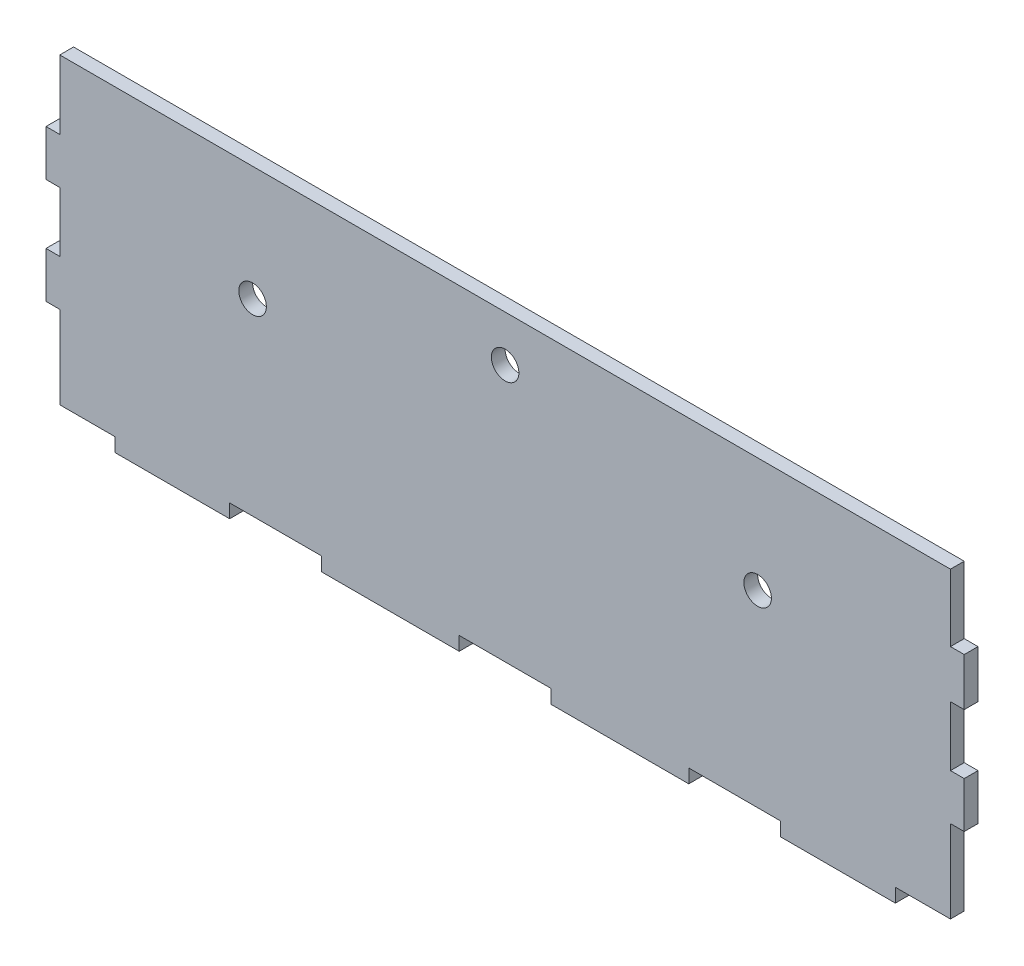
ISO-10303-21;
HEADER;
FILE_DESCRIPTION(('STEP AP214'),'2;1');
FILE_NAME('part.step','',(''),(''),'','','');
FILE_SCHEMA(('AUTOMOTIVE_DESIGN { 1 0 10303 214 1 1 1 1 }'));
ENDSEC;
DATA;
#1=APPLICATION_CONTEXT('core data for automotive mechanical design processes');
#2=APPLICATION_PROTOCOL_DEFINITION('international standard','automotive_design',2000,#1);
#3=PRODUCT_CONTEXT('',#1,'mechanical');
#4=PRODUCT('Part','Part','',(#3));
#5=PRODUCT_RELATED_PRODUCT_CATEGORY('part','',(#4));
#6=PRODUCT_DEFINITION_FORMATION('','',#4);
#7=PRODUCT_DEFINITION_CONTEXT('part definition',#1,'design');
#8=PRODUCT_DEFINITION('design','',#6,#7);
#9=PRODUCT_DEFINITION_SHAPE('','',#8);
#10=(LENGTH_UNIT() NAMED_UNIT(*) SI_UNIT(.MILLI.,.METRE.));
#11=(NAMED_UNIT(*) PLANE_ANGLE_UNIT() SI_UNIT($,.RADIAN.));
#12=(NAMED_UNIT(*) SI_UNIT($,.STERADIAN.) SOLID_ANGLE_UNIT());
#13=UNCERTAINTY_MEASURE_WITH_UNIT(LENGTH_MEASURE(1.E-05),#10,'distance_accuracy_value','');
#14=(GEOMETRIC_REPRESENTATION_CONTEXT(3) GLOBAL_UNCERTAINTY_ASSIGNED_CONTEXT((#13)) GLOBAL_UNIT_ASSIGNED_CONTEXT((#10,
#11,#12)) REPRESENTATION_CONTEXT('',''));
#15=CARTESIAN_POINT('',(0.,0.,0.));
#16=DIRECTION('',(0.,0.,1.));
#17=DIRECTION('',(1.,0.,0.));
#18=AXIS2_PLACEMENT_3D('',#15,#16,#17);
#19=CARTESIAN_POINT('',(0.,0.,3.));
#20=DIRECTION('',(1.,0.,0.));
#21=DIRECTION('',(0.,0.,-1.));
#22=AXIS2_PLACEMENT_3D('',#19,#20,#21);
#23=PLANE('',#22);
#24=DIRECTION('',(0.,-1.,0.));
#25=VECTOR('',#24,1.);
#26=CARTESIAN_POINT('',(0.,0.,3.));
#27=LINE('',#26,#25);
#28=CARTESIAN_POINT('',(0.,31.,3.));
#29=VERTEX_POINT('',#28);
#30=CARTESIAN_POINT('',(0.,21.,3.));
#31=VERTEX_POINT('',#30);
#32=EDGE_CURVE('E444',#29,#31,#27,.T.);
#33=ORIENTED_EDGE('',*,*,#32,.F.);
#34=DIRECTION('',(0.,0.,1.));
#35=VECTOR('',#34,1.);
#36=CARTESIAN_POINT('',(0.,31.,-3.));
#37=LINE('',#36,#35);
#38=CARTESIAN_POINT('',(0.,31.,0.));
#39=VERTEX_POINT('',#38);
#40=EDGE_CURVE('E317',#39,#29,#37,.T.);
#41=ORIENTED_EDGE('',*,*,#40,.F.);
#42=DIRECTION('',(0.,-1.,0.));
#43=VECTOR('',#42,1.);
#44=CARTESIAN_POINT('',(0.,0.,0.));
#45=LINE('',#44,#43);
#46=CARTESIAN_POINT('',(0.,21.,0.));
#47=VERTEX_POINT('',#46);
#48=EDGE_CURVE('E457',#39,#47,#45,.T.);
#49=ORIENTED_EDGE('',*,*,#48,.T.);
#50=DIRECTION('',(0.,0.,1.));
#51=VECTOR('',#50,1.);
#52=CARTESIAN_POINT('',(0.,21.,-3.));
#53=LINE('',#52,#51);
#54=EDGE_CURVE('E388',#47,#31,#53,.T.);
#55=ORIENTED_EDGE('',*,*,#54,.T.);
#56=EDGE_LOOP('',(#33,#41,#49,#55));
#57=FACE_BOUND('',#56,.T.);
#58=ADVANCED_FACE('F36',(#57),#23,.F.);
#59=CARTESIAN_POINT('',(0.,0.,3.));
#60=DIRECTION('',(0.,1.,0.));
#61=DIRECTION('',(0.,0.,1.));
#62=AXIS2_PLACEMENT_3D('',#59,#60,#61);
#63=PLANE('',#62);
#64=DIRECTION('',(1.,0.,0.));
#65=VECTOR('',#64,1.);
#66=CARTESIAN_POINT('',(0.,0.,3.));
#67=LINE('',#66,#65);
#68=CARTESIAN_POINT('',(60.,0.,3.));
#69=VERTEX_POINT('',#68);
#70=CARTESIAN_POINT('',(90.,0.,3.));
#71=VERTEX_POINT('',#70);
#72=EDGE_CURVE('E617',#69,#71,#67,.T.);
#73=ORIENTED_EDGE('',*,*,#72,.F.);
#74=DIRECTION('',(0.,0.,1.));
#75=VECTOR('',#74,1.);
#76=CARTESIAN_POINT('',(60.,0.,-3.));
#77=LINE('',#76,#75);
#78=CARTESIAN_POINT('',(60.,0.,0.));
#79=VERTEX_POINT('',#78);
#80=EDGE_CURVE('E303',#79,#69,#77,.T.);
#81=ORIENTED_EDGE('',*,*,#80,.F.);
#82=DIRECTION('',(1.,0.,0.));
#83=VECTOR('',#82,1.);
#84=CARTESIAN_POINT('',(0.,0.,0.));
#85=LINE('',#84,#83);
#86=CARTESIAN_POINT('',(90.,0.,0.));
#87=VERTEX_POINT('',#86);
#88=EDGE_CURVE('E599',#79,#87,#85,.T.);
#89=ORIENTED_EDGE('',*,*,#88,.T.);
#90=DIRECTION('',(0.,0.,1.));
#91=VECTOR('',#90,1.);
#92=CARTESIAN_POINT('',(90.,0.,-3.));
#93=LINE('',#92,#91);
#94=EDGE_CURVE('E373',#87,#71,#93,.T.);
#95=ORIENTED_EDGE('',*,*,#94,.T.);
#96=EDGE_LOOP('',(#73,#81,#89,#95));
#97=FACE_BOUND('',#96,.T.);
#98=ADVANCED_FACE('F618',(#97),#63,.F.);
#99=CARTESIAN_POINT('',(160.,0.,0.));
#100=VERTEX_POINT('',#99);
#101=CARTESIAN_POINT('',(185.,0.,0.));
#102=VERTEX_POINT('',#101);
#103=EDGE_CURVE('E461',#100,#102,#85,.T.);
#104=ORIENTED_EDGE('',*,*,#103,.T.);
#105=DIRECTION('',(0.,0.,1.));
#106=VECTOR('',#105,1.);
#107=CARTESIAN_POINT('',(185.,0.,-3.));
#108=LINE('',#107,#106);
#109=CARTESIAN_POINT('',(185.,0.,3.));
#110=VERTEX_POINT('',#109);
#111=EDGE_CURVE('E408',#102,#110,#108,.T.);
#112=ORIENTED_EDGE('',*,*,#111,.T.);
#113=CARTESIAN_POINT('',(160.,0.,3.));
#114=VERTEX_POINT('',#113);
#115=EDGE_CURVE('E449',#114,#110,#67,.T.);
#116=ORIENTED_EDGE('',*,*,#115,.F.);
#117=DIRECTION('',(0.,0.,1.));
#118=VECTOR('',#117,1.);
#119=CARTESIAN_POINT('',(160.,0.,-3.));
#120=LINE('',#119,#118);
#121=EDGE_CURVE('E356',#100,#114,#120,.T.);
#122=ORIENTED_EDGE('',*,*,#121,.F.);
#123=EDGE_LOOP('',(#104,#112,#116,#122));
#124=FACE_BOUND('',#123,.T.);
#125=ADVANCED_FACE('F577',(#124),#63,.F.);
#126=CARTESIAN_POINT('',(110.,0.,0.));
#127=VERTEX_POINT('',#126);
#128=CARTESIAN_POINT('',(140.,0.,0.));
#129=VERTEX_POINT('',#128);
#130=EDGE_CURVE('E464',#127,#129,#85,.T.);
#131=ORIENTED_EDGE('',*,*,#130,.T.);
#132=DIRECTION('',(0.,0.,1.));
#133=VECTOR('',#132,1.);
#134=CARTESIAN_POINT('',(140.,0.,-3.));
#135=LINE('',#134,#133);
#136=CARTESIAN_POINT('',(140.,0.,3.));
#137=VERTEX_POINT('',#136);
#138=EDGE_CURVE('E358',#129,#137,#135,.T.);
#139=ORIENTED_EDGE('',*,*,#138,.T.);
#140=CARTESIAN_POINT('',(110.,0.,3.));
#141=VERTEX_POINT('',#140);
#142=EDGE_CURVE('E452',#141,#137,#67,.T.);
#143=ORIENTED_EDGE('',*,*,#142,.F.);
#144=DIRECTION('',(0.,0.,1.));
#145=VECTOR('',#144,1.);
#146=CARTESIAN_POINT('',(110.,0.,-3.));
#147=LINE('',#146,#145);
#148=EDGE_CURVE('E371',#127,#141,#147,.T.);
#149=ORIENTED_EDGE('',*,*,#148,.F.);
#150=EDGE_LOOP('',(#131,#139,#143,#149));
#151=FACE_BOUND('',#150,.T.);
#152=ADVANCED_FACE('F597',(#151),#63,.F.);
#153=CARTESIAN_POINT('',(200.,0.,3.));
#154=DIRECTION('',(-1.,0.,0.));
#155=DIRECTION('',(0.,0.,1.));
#156=AXIS2_PLACEMENT_3D('',#153,#154,#155);
#157=PLANE('',#156);
#158=DIRECTION('',(0.,1.,0.));
#159=VECTOR('',#158,1.);
#160=CARTESIAN_POINT('',(200.,0.,3.));
#161=LINE('',#160,#159);
#162=CARTESIAN_POINT('',(200.,44.,3.));
#163=VERTEX_POINT('',#162);
#164=CARTESIAN_POINT('',(200.,54.3929814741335,3.));
#165=VERTEX_POINT('',#164);
#166=EDGE_CURVE('E453',#163,#165,#161,.T.);
#167=ORIENTED_EDGE('',*,*,#166,.F.);
#168=DIRECTION('',(0.,0.,1.));
#169=VECTOR('',#168,1.);
#170=CARTESIAN_POINT('',(200.,44.,-3.));
#171=LINE('',#170,#169);
#172=CARTESIAN_POINT('',(200.,44.,0.));
#173=VERTEX_POINT('',#172);
#174=EDGE_CURVE('E334',#173,#163,#171,.T.);
#175=ORIENTED_EDGE('',*,*,#174,.F.);
#176=DIRECTION('',(0.,1.,0.));
#177=VECTOR('',#176,1.);
#178=CARTESIAN_POINT('',(200.,0.,0.));
#179=LINE('',#178,#177);
#180=CARTESIAN_POINT('',(200.,54.3929814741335,0.));
#181=VERTEX_POINT('',#180);
#182=EDGE_CURVE('E466',#173,#181,#179,.T.);
#183=ORIENTED_EDGE('',*,*,#182,.T.);
#184=DIRECTION('',(0.,0.,1.));
#185=VECTOR('',#184,1.);
#186=CARTESIAN_POINT('',(200.,54.3929814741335,-3.));
#187=LINE('',#186,#185);
#188=EDGE_CURVE('E431',#181,#165,#187,.T.);
#189=ORIENTED_EDGE('',*,*,#188,.T.);
#190=EDGE_LOOP('',(#167,#175,#183,#189));
#191=FACE_BOUND('',#190,.T.);
#192=ADVANCED_FACE('F545',(#191),#157,.F.);
#193=CARTESIAN_POINT('',(0.,54.,0.));
#194=VERTEX_POINT('',#193);
#195=CARTESIAN_POINT('',(0.,44.,0.));
#196=VERTEX_POINT('',#195);
#197=EDGE_CURVE('E460',#194,#196,#45,.T.);
#198=ORIENTED_EDGE('',*,*,#197,.T.);
#199=DIRECTION('',(0.,0.,1.));
#200=VECTOR('',#199,1.);
#201=CARTESIAN_POINT('',(0.,44.,-3.));
#202=LINE('',#201,#200);
#203=CARTESIAN_POINT('',(0.,44.,3.));
#204=VERTEX_POINT('',#203);
#205=EDGE_CURVE('E319',#196,#204,#202,.T.);
#206=ORIENTED_EDGE('',*,*,#205,.T.);
#207=CARTESIAN_POINT('',(0.,54.,3.));
#208=VERTEX_POINT('',#207);
#209=EDGE_CURVE('E447',#208,#204,#27,.T.);
#210=ORIENTED_EDGE('',*,*,#209,.F.);
#211=DIRECTION('',(0.,0.,1.));
#212=VECTOR('',#211,1.);
#213=CARTESIAN_POINT('',(0.,54.,-3.));
#214=LINE('',#213,#212);
#215=EDGE_CURVE('E430',#194,#208,#214,.T.);
#216=ORIENTED_EDGE('',*,*,#215,.F.);
#217=EDGE_LOOP('',(#198,#206,#210,#216));
#218=FACE_BOUND('',#217,.T.);
#219=ADVANCED_FACE('F38',(#218),#23,.F.);
#220=CARTESIAN_POINT('',(15.,0.,0.));
#221=VERTEX_POINT('',#220);
#222=CARTESIAN_POINT('',(40.,0.,0.));
#223=VERTEX_POINT('',#222);
#224=EDGE_CURVE('E465',#221,#223,#85,.T.);
#225=ORIENTED_EDGE('',*,*,#224,.T.);
#226=DIRECTION('',(0.,0.,1.));
#227=VECTOR('',#226,1.);
#228=CARTESIAN_POINT('',(40.,0.,-3.));
#229=LINE('',#228,#227);
#230=CARTESIAN_POINT('',(40.,0.,3.));
#231=VERTEX_POINT('',#230);
#232=EDGE_CURVE('E278',#223,#231,#229,.T.);
#233=ORIENTED_EDGE('',*,*,#232,.T.);
#234=CARTESIAN_POINT('',(15.,0.,3.));
#235=VERTEX_POINT('',#234);
#236=EDGE_CURVE('E296',#235,#231,#67,.T.);
#237=ORIENTED_EDGE('',*,*,#236,.F.);
#238=DIRECTION('',(0.,0.,1.));
#239=VECTOR('',#238,1.);
#240=CARTESIAN_POINT('',(15.,0.,-3.));
#241=LINE('',#240,#239);
#242=EDGE_CURVE('E395',#221,#235,#241,.T.);
#243=ORIENTED_EDGE('',*,*,#242,.F.);
#244=EDGE_LOOP('',(#225,#233,#237,#243));
#245=FACE_BOUND('',#244,.T.);
#246=ADVANCED_FACE('F608',(#245),#63,.F.);
#247=CARTESIAN_POINT('',(200.,21.,0.));
#248=VERTEX_POINT('',#247);
#249=CARTESIAN_POINT('',(200.,31.,0.));
#250=VERTEX_POINT('',#249);
#251=EDGE_CURVE('E448',#248,#250,#179,.T.);
#252=ORIENTED_EDGE('',*,*,#251,.T.);
#253=DIRECTION('',(0.,0.,1.));
#254=VECTOR('',#253,1.);
#255=CARTESIAN_POINT('',(200.,31.,-3.));
#256=LINE('',#255,#254);
#257=CARTESIAN_POINT('',(200.,31.,3.));
#258=VERTEX_POINT('',#257);
#259=EDGE_CURVE('E336',#250,#258,#256,.T.);
#260=ORIENTED_EDGE('',*,*,#259,.T.);
#261=CARTESIAN_POINT('',(200.,21.,3.));
#262=VERTEX_POINT('',#261);
#263=EDGE_CURVE('E456',#262,#258,#161,.T.);
#264=ORIENTED_EDGE('',*,*,#263,.F.);
#265=DIRECTION('',(0.,0.,1.));
#266=VECTOR('',#265,1.);
#267=CARTESIAN_POINT('',(200.,21.,-3.));
#268=LINE('',#267,#266);
#269=EDGE_CURVE('E413',#248,#262,#268,.T.);
#270=ORIENTED_EDGE('',*,*,#269,.F.);
#271=EDGE_LOOP('',(#252,#260,#264,#270));
#272=FACE_BOUND('',#271,.T.);
#273=ADVANCED_FACE('F555',(#272),#157,.F.);
#274=CARTESIAN_POINT('',(0.,0.,3.));
#275=DIRECTION('',(0.,0.,-1.));
#276=DIRECTION('',(-1.,0.,0.));
#277=AXIS2_PLACEMENT_3D('',#274,#275,#276);
#278=PLANE('',#277);
#279=CARTESIAN_POINT('',(100.,59.,3.));
#280=DIRECTION('',(0.,0.,1.));
#281=DIRECTION('',(1.,0.,0.));
#282=AXIS2_PLACEMENT_3D('',#279,#280,#281);
#283=CIRCLE('',#282,3.00000000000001);
#284=CARTESIAN_POINT('',(103.,59.,3.));
#285=VERTEX_POINT('',#284);
#286=EDGE_CURVE('E327',#285,#285,#283,.T.);
#287=ORIENTED_EDGE('',*,*,#286,.F.);
#288=EDGE_LOOP('',(#287));
#289=FACE_BOUND('',#288,.T.);
#290=CARTESIAN_POINT('',(155.,44.,3.));
#291=DIRECTION('',(0.,0.,1.));
#292=DIRECTION('',(1.,0.,0.));
#293=AXIS2_PLACEMENT_3D('',#290,#291,#292);
#294=CIRCLE('',#293,2.99999999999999);
#295=CARTESIAN_POINT('',(158.,44.,3.));
#296=VERTEX_POINT('',#295);
#297=EDGE_CURVE('E342',#296,#296,#294,.T.);
#298=ORIENTED_EDGE('',*,*,#297,.F.);
#299=EDGE_LOOP('',(#298));
#300=FACE_BOUND('',#299,.T.);
#301=CARTESIAN_POINT('',(45.,44.,3.));
#302=DIRECTION('',(0.,0.,1.));
#303=DIRECTION('',(-1.,0.,0.));
#304=AXIS2_PLACEMENT_3D('',#301,#302,#303);
#305=CIRCLE('',#304,2.99999999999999);
#306=CARTESIAN_POINT('',(42.,44.,3.));
#307=VERTEX_POINT('',#306);
#308=EDGE_CURVE('E983',#307,#307,#305,.T.);
#309=ORIENTED_EDGE('',*,*,#308,.F.);
#310=EDGE_LOOP('',(#309));
#311=FACE_BOUND('',#310,.T.);
#312=DIRECTION('',(0.,-1.,0.));
#313=VECTOR('',#312,1.);
#314=CARTESIAN_POINT('',(197.,31.,3.));
#315=LINE('',#314,#313);
#316=CARTESIAN_POINT('',(197.,44.,3.));
#317=VERTEX_POINT('',#316);
#318=CARTESIAN_POINT('',(197.,31.,3.));
#319=VERTEX_POINT('',#318);
#320=EDGE_CURVE('E323',#317,#319,#315,.T.);
#321=ORIENTED_EDGE('',*,*,#320,.F.);
#322=DIRECTION('',(-1.,0.,0.));
#323=VECTOR('',#322,1.);
#324=CARTESIAN_POINT('',(197.,44.,3.));
#325=LINE('',#324,#323);
#326=EDGE_CURVE('E329',#163,#317,#325,.T.);
#327=ORIENTED_EDGE('',*,*,#326,.F.);
#328=ORIENTED_EDGE('',*,*,#166,.T.);
#329=DIRECTION('',(1.,0.,0.));
#330=VECTOR('',#329,1.);
#331=CARTESIAN_POINT('',(200.,54.3929814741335,3.));
#332=LINE('',#331,#330);
#333=CARTESIAN_POINT('',(197.,54.3929814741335,3.));
#334=VERTEX_POINT('',#333);
#335=EDGE_CURVE('E428',#334,#165,#332,.T.);
#336=ORIENTED_EDGE('',*,*,#335,.F.);
#337=DIRECTION('',(0.,-1.,0.));
#338=VECTOR('',#337,1.);
#339=CARTESIAN_POINT('',(197.,54.3929814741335,3.));
#340=LINE('',#339,#338);
#341=CARTESIAN_POINT('',(197.,69.,3.));
#342=VERTEX_POINT('',#341);
#343=EDGE_CURVE('E425',#342,#334,#340,.T.);
#344=ORIENTED_EDGE('',*,*,#343,.F.);
#345=DIRECTION('',(1.,0.,0.));
#346=VECTOR('',#345,1.);
#347=CARTESIAN_POINT('',(3.,69.,3.));
#348=LINE('',#347,#346);
#349=CARTESIAN_POINT('',(3.,69.,3.));
#350=VERTEX_POINT('',#349);
#351=EDGE_CURVE('E422',#350,#342,#348,.T.);
#352=ORIENTED_EDGE('',*,*,#351,.F.);
#353=DIRECTION('',(0.,1.,0.));
#354=VECTOR('',#353,1.);
#355=CARTESIAN_POINT('',(3.,69.,3.));
#356=LINE('',#355,#354);
#357=CARTESIAN_POINT('',(3.,54.,3.));
#358=VERTEX_POINT('',#357);
#359=EDGE_CURVE('E419',#358,#350,#356,.T.);
#360=ORIENTED_EDGE('',*,*,#359,.F.);
#361=DIRECTION('',(1.,0.,0.));
#362=VECTOR('',#361,1.);
#363=CARTESIAN_POINT('',(3.,54.,3.));
#364=LINE('',#363,#362);
#365=EDGE_CURVE('E391',#208,#358,#364,.T.);
#366=ORIENTED_EDGE('',*,*,#365,.F.);
#367=ORIENTED_EDGE('',*,*,#209,.T.);
#368=DIRECTION('',(-1.,0.,0.));
#369=VECTOR('',#368,1.);
#370=CARTESIAN_POINT('',(3.,44.,3.));
#371=LINE('',#370,#369);
#372=CARTESIAN_POINT('',(3.,44.,3.));
#373=VERTEX_POINT('',#372);
#374=EDGE_CURVE('E309',#373,#204,#371,.T.);
#375=ORIENTED_EDGE('',*,*,#374,.F.);
#376=DIRECTION('',(0.,1.,0.));
#377=VECTOR('',#376,1.);
#378=CARTESIAN_POINT('',(3.,44.,3.));
#379=LINE('',#378,#377);
#380=CARTESIAN_POINT('',(3.,31.,3.));
#381=VERTEX_POINT('',#380);
#382=EDGE_CURVE('E306',#381,#373,#379,.T.);
#383=ORIENTED_EDGE('',*,*,#382,.F.);
#384=DIRECTION('',(1.,0.,0.));
#385=VECTOR('',#384,1.);
#386=CARTESIAN_POINT('',(3.,31.,3.));
#387=LINE('',#386,#385);
#388=EDGE_CURVE('E312',#29,#381,#387,.T.);
#389=ORIENTED_EDGE('',*,*,#388,.F.);
#390=ORIENTED_EDGE('',*,*,#32,.T.);
#391=DIRECTION('',(-1.,0.,0.));
#392=VECTOR('',#391,1.);
#393=CARTESIAN_POINT('',(3.,21.,3.));
#394=LINE('',#393,#392);
#395=CARTESIAN_POINT('',(3.,21.,3.));
#396=VERTEX_POINT('',#395);
#397=EDGE_CURVE('E377',#396,#31,#394,.T.);
#398=ORIENTED_EDGE('',*,*,#397,.F.);
#399=DIRECTION('',(0.,1.,0.));
#400=VECTOR('',#399,1.);
#401=CARTESIAN_POINT('',(3.,3.,3.));
#402=LINE('',#401,#400);
#403=CARTESIAN_POINT('',(3.,3.,3.));
#404=VERTEX_POINT('',#403);
#405=EDGE_CURVE('E385',#404,#396,#402,.T.);
#406=ORIENTED_EDGE('',*,*,#405,.F.);
#407=DIRECTION('',(-1.,0.,0.));
#408=VECTOR('',#407,1.);
#409=CARTESIAN_POINT('',(15.,3.,3.));
#410=LINE('',#409,#408);
#411=CARTESIAN_POINT('',(15.,3.,3.));
#412=VERTEX_POINT('',#411);
#413=EDGE_CURVE('E382',#412,#404,#410,.T.);
#414=ORIENTED_EDGE('',*,*,#413,.F.);
#415=DIRECTION('',(0.,1.,0.));
#416=VECTOR('',#415,1.);
#417=CARTESIAN_POINT('',(15.,0.,3.));
#418=LINE('',#417,#416);
#419=EDGE_CURVE('E379',#235,#412,#418,.T.);
#420=ORIENTED_EDGE('',*,*,#419,.F.);
#421=ORIENTED_EDGE('',*,*,#236,.T.);
#422=DIRECTION('',(0.,-1.,0.));
#423=VECTOR('',#422,1.);
#424=CARTESIAN_POINT('',(40.,3.,3.));
#425=LINE('',#424,#423);
#426=CARTESIAN_POINT('',(40.,3.,3.));
#427=VERTEX_POINT('',#426);
#428=EDGE_CURVE('E272',#427,#231,#425,.T.);
#429=ORIENTED_EDGE('',*,*,#428,.F.);
#430=DIRECTION('',(-1.,0.,0.));
#431=VECTOR('',#430,1.);
#432=CARTESIAN_POINT('',(40.,3.,3.));
#433=LINE('',#432,#431);
#434=CARTESIAN_POINT('',(60.,3.,3.));
#435=VERTEX_POINT('',#434);
#436=EDGE_CURVE('E282',#435,#427,#433,.T.);
#437=ORIENTED_EDGE('',*,*,#436,.F.);
#438=DIRECTION('',(0.,1.,0.));
#439=VECTOR('',#438,1.);
#440=CARTESIAN_POINT('',(60.,3.,3.));
#441=LINE('',#440,#439);
#442=EDGE_CURVE('E279',#69,#435,#441,.T.);
#443=ORIENTED_EDGE('',*,*,#442,.F.);
#444=ORIENTED_EDGE('',*,*,#72,.T.);
#445=DIRECTION('',(0.,-1.,0.));
#446=VECTOR('',#445,1.);
#447=CARTESIAN_POINT('',(90.,3.,3.));
#448=LINE('',#447,#446);
#449=CARTESIAN_POINT('',(90.,3.,3.));
#450=VERTEX_POINT('',#449);
#451=EDGE_CURVE('E364',#450,#71,#448,.T.);
#452=ORIENTED_EDGE('',*,*,#451,.F.);
#453=DIRECTION('',(-1.,0.,0.));
#454=VECTOR('',#453,1.);
#455=CARTESIAN_POINT('',(90.,3.,3.));
#456=LINE('',#455,#454);
#457=CARTESIAN_POINT('',(110.,3.,3.));
#458=VERTEX_POINT('',#457);
#459=EDGE_CURVE('E302',#458,#450,#456,.T.);
#460=ORIENTED_EDGE('',*,*,#459,.F.);
#461=DIRECTION('',(0.,1.,0.));
#462=VECTOR('',#461,1.);
#463=CARTESIAN_POINT('',(110.,3.,3.));
#464=LINE('',#463,#462);
#465=EDGE_CURVE('E366',#141,#458,#464,.T.);
#466=ORIENTED_EDGE('',*,*,#465,.F.);
#467=ORIENTED_EDGE('',*,*,#142,.T.);
#468=DIRECTION('',(0.,-1.,0.));
#469=VECTOR('',#468,1.);
#470=CARTESIAN_POINT('',(140.,3.,3.));
#471=LINE('',#470,#469);
#472=CARTESIAN_POINT('',(140.,3.,3.));
#473=VERTEX_POINT('',#472);
#474=EDGE_CURVE('E346',#473,#137,#471,.T.);
#475=ORIENTED_EDGE('',*,*,#474,.F.);
#476=DIRECTION('',(-1.,0.,0.));
#477=VECTOR('',#476,1.);
#478=CARTESIAN_POINT('',(140.,3.,3.));
#479=LINE('',#478,#477);
#480=CARTESIAN_POINT('',(160.,3.,3.));
#481=VERTEX_POINT('',#480);
#482=EDGE_CURVE('E343',#481,#473,#479,.T.);
#483=ORIENTED_EDGE('',*,*,#482,.F.);
#484=DIRECTION('',(0.,1.,0.));
#485=VECTOR('',#484,1.);
#486=CARTESIAN_POINT('',(160.,3.,3.));
#487=LINE('',#486,#485);
#488=EDGE_CURVE('E349',#114,#481,#487,.T.);
#489=ORIENTED_EDGE('',*,*,#488,.F.);
#490=ORIENTED_EDGE('',*,*,#115,.T.);
#491=DIRECTION('',(0.,-1.,0.));
#492=VECTOR('',#491,1.);
#493=CARTESIAN_POINT('',(185.,0.,3.));
#494=LINE('',#493,#492);
#495=CARTESIAN_POINT('',(185.,3.,3.));
#496=VERTEX_POINT('',#495);
#497=EDGE_CURVE('E355',#496,#110,#494,.T.);
#498=ORIENTED_EDGE('',*,*,#497,.F.);
#499=DIRECTION('',(-1.,0.,0.));
#500=VECTOR('',#499,1.);
#501=CARTESIAN_POINT('',(185.,3.,3.));
#502=LINE('',#501,#500);
#503=CARTESIAN_POINT('',(197.000000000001,3.00000000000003,3.));
#504=VERTEX_POINT('',#503);
#505=EDGE_CURVE('E405',#504,#496,#502,.T.);
#506=ORIENTED_EDGE('',*,*,#505,.F.);
#507=DIRECTION('',(0.,-1.,0.));
#508=VECTOR('',#507,1.);
#509=CARTESIAN_POINT('',(197.000000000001,20.9999999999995,3.));
#510=LINE('',#509,#508);
#511=CARTESIAN_POINT('',(197.000000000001,20.9999999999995,3.));
#512=VERTEX_POINT('',#511);
#513=EDGE_CURVE('E402',#512,#504,#510,.T.);
#514=ORIENTED_EDGE('',*,*,#513,.F.);
#515=DIRECTION('',(-1.,-1.59594559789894E-13,0.));
#516=VECTOR('',#515,1.);
#517=CARTESIAN_POINT('',(197.000000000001,20.9999999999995,3.));
#518=LINE('',#517,#516);
#519=EDGE_CURVE('E400',#262,#512,#518,.T.);
#520=ORIENTED_EDGE('',*,*,#519,.F.);
#521=ORIENTED_EDGE('',*,*,#263,.T.);
#522=DIRECTION('',(1.,0.,0.));
#523=VECTOR('',#522,1.);
#524=CARTESIAN_POINT('',(197.,31.,3.));
#525=LINE('',#524,#523);
#526=EDGE_CURVE('E326',#319,#258,#525,.T.);
#527=ORIENTED_EDGE('',*,*,#526,.F.);
#528=EDGE_LOOP('',(#321,#327,#328,#336,#344,#352,#360,#366,#367,#375,#383,#389,#390,#398,#406,
#414,#420,#421,#429,#437,#443,#444,#452,#460,#466,#467,#475,#483,#489,#490,#498,#506,#514,#520,
#521,#527));
#529=FACE_BOUND('',#528,.T.);
#530=ADVANCED_FACE('F293',(#289,#300,#311,#529),#278,.F.);
#531=CARTESIAN_POINT('',(0.,0.,0.));
#532=DIRECTION('',(0.,0.,-1.));
#533=DIRECTION('',(-1.,0.,0.));
#534=AXIS2_PLACEMENT_3D('',#531,#532,#533);
#535=PLANE('',#534);
#536=CARTESIAN_POINT('',(100.,59.,0.));
#537=DIRECTION('',(0.,0.,-1.));
#538=DIRECTION('',(-1.,0.,0.));
#539=AXIS2_PLACEMENT_3D('',#536,#537,#538);
#540=CIRCLE('',#539,3.00000000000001);
#541=CARTESIAN_POINT('',(97.,59.,0.));
#542=VERTEX_POINT('',#541);
#543=EDGE_CURVE('E40',#542,#542,#540,.T.);
#544=ORIENTED_EDGE('',*,*,#543,.F.);
#545=EDGE_LOOP('',(#544));
#546=FACE_BOUND('',#545,.T.);
#547=DIRECTION('',(1.,0.,0.));
#548=VECTOR('',#547,1.);
#549=CARTESIAN_POINT('',(0.,44.,0.));
#550=LINE('',#549,#548);
#551=CARTESIAN_POINT('',(197.,44.,0.));
#552=VERTEX_POINT('',#551);
#553=EDGE_CURVE('E11',#552,#173,#550,.T.);
#554=ORIENTED_EDGE('',*,*,#553,.F.);
#555=DIRECTION('',(0.,1.,0.));
#556=VECTOR('',#555,1.);
#557=CARTESIAN_POINT('',(197.,0.,0.));
#558=LINE('',#557,#556);
#559=CARTESIAN_POINT('',(197.,31.,0.));
#560=VERTEX_POINT('',#559);
#561=EDGE_CURVE('E45',#560,#552,#558,.T.);
#562=ORIENTED_EDGE('',*,*,#561,.F.);
#563=DIRECTION('',(-1.,0.,0.));
#564=VECTOR('',#563,1.);
#565=CARTESIAN_POINT('',(0.,31.,0.));
#566=LINE('',#565,#564);
#567=EDGE_CURVE('E524',#250,#560,#566,.T.);
#568=ORIENTED_EDGE('',*,*,#567,.F.);
#569=ORIENTED_EDGE('',*,*,#251,.F.);
#570=DIRECTION('',(1.,1.59594559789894E-13,0.));
#571=VECTOR('',#570,1.);
#572=CARTESIAN_POINT('',(-3.35148575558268E-12,20.9999999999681,0.));
#573=LINE('',#572,#571);
#574=CARTESIAN_POINT('',(197.000000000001,20.9999999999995,0.));
#575=VERTEX_POINT('',#574);
#576=EDGE_CURVE('E497',#575,#248,#573,.T.);
#577=ORIENTED_EDGE('',*,*,#576,.F.);
#578=DIRECTION('',(0.,1.,0.));
#579=VECTOR('',#578,1.);
#580=CARTESIAN_POINT('',(197.000000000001,0.,0.));
#581=LINE('',#580,#579);
#582=CARTESIAN_POINT('',(197.000000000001,3.00000000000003,0.));
#583=VERTEX_POINT('',#582);
#584=EDGE_CURVE('E499',#583,#575,#581,.T.);
#585=ORIENTED_EDGE('',*,*,#584,.F.);
#586=DIRECTION('',(1.,0.,0.));
#587=VECTOR('',#586,1.);
#588=CARTESIAN_POINT('',(0.,2.99999999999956,0.));
#589=LINE('',#588,#587);
#590=CARTESIAN_POINT('',(185.,3.,0.));
#591=VERTEX_POINT('',#590);
#592=EDGE_CURVE('E501',#591,#583,#589,.T.);
#593=ORIENTED_EDGE('',*,*,#592,.F.);
#594=DIRECTION('',(0.,1.,0.));
#595=VECTOR('',#594,1.);
#596=CARTESIAN_POINT('',(185.,0.,0.));
#597=LINE('',#596,#595);
#598=EDGE_CURVE('E503',#102,#591,#597,.T.);
#599=ORIENTED_EDGE('',*,*,#598,.F.);
#600=ORIENTED_EDGE('',*,*,#103,.F.);
#601=DIRECTION('',(0.,-1.,0.));
#602=VECTOR('',#601,1.);
#603=CARTESIAN_POINT('',(160.,0.,0.));
#604=LINE('',#603,#602);
#605=CARTESIAN_POINT('',(160.,3.,0.));
#606=VERTEX_POINT('',#605);
#607=EDGE_CURVE('E495',#606,#100,#604,.T.);
#608=ORIENTED_EDGE('',*,*,#607,.F.);
#609=DIRECTION('',(1.,0.,0.));
#610=VECTOR('',#609,1.);
#611=CARTESIAN_POINT('',(0.,3.,0.));
#612=LINE('',#611,#610);
#613=CARTESIAN_POINT('',(140.,3.,0.));
#614=VERTEX_POINT('',#613);
#615=EDGE_CURVE('E493',#614,#606,#612,.T.);
#616=ORIENTED_EDGE('',*,*,#615,.F.);
#617=DIRECTION('',(0.,1.,0.));
#618=VECTOR('',#617,1.);
#619=CARTESIAN_POINT('',(140.,0.,0.));
#620=LINE('',#619,#618);
#621=EDGE_CURVE('E491',#129,#614,#620,.T.);
#622=ORIENTED_EDGE('',*,*,#621,.F.);
#623=ORIENTED_EDGE('',*,*,#130,.F.);
#624=DIRECTION('',(0.,-1.,0.));
#625=VECTOR('',#624,1.);
#626=CARTESIAN_POINT('',(110.,0.,0.));
#627=LINE('',#626,#625);
#628=CARTESIAN_POINT('',(110.,3.,0.));
#629=VERTEX_POINT('',#628);
#630=EDGE_CURVE('E489',#629,#127,#627,.T.);
#631=ORIENTED_EDGE('',*,*,#630,.F.);
#632=DIRECTION('',(1.,0.,0.));
#633=VECTOR('',#632,1.);
#634=CARTESIAN_POINT('',(0.,3.,0.));
#635=LINE('',#634,#633);
#636=CARTESIAN_POINT('',(90.,3.,0.));
#637=VERTEX_POINT('',#636);
#638=EDGE_CURVE('E487',#637,#629,#635,.T.);
#639=ORIENTED_EDGE('',*,*,#638,.F.);
#640=DIRECTION('',(0.,1.,0.));
#641=VECTOR('',#640,1.);
#642=CARTESIAN_POINT('',(90.,0.,0.));
#643=LINE('',#642,#641);
#644=EDGE_CURVE('E480',#87,#637,#643,.T.);
#645=ORIENTED_EDGE('',*,*,#644,.F.);
#646=ORIENTED_EDGE('',*,*,#88,.F.);
#647=DIRECTION('',(0.,-1.,0.));
#648=VECTOR('',#647,1.);
#649=CARTESIAN_POINT('',(60.,0.,0.));
#650=LINE('',#649,#648);
#651=CARTESIAN_POINT('',(60.,3.,0.));
#652=VERTEX_POINT('',#651);
#653=EDGE_CURVE('E516',#652,#79,#650,.T.);
#654=ORIENTED_EDGE('',*,*,#653,.F.);
#655=DIRECTION('',(1.,0.,0.));
#656=VECTOR('',#655,1.);
#657=CARTESIAN_POINT('',(0.,3.,0.));
#658=LINE('',#657,#656);
#659=CARTESIAN_POINT('',(40.,3.,0.));
#660=VERTEX_POINT('',#659);
#661=EDGE_CURVE('E514',#660,#652,#658,.T.);
#662=ORIENTED_EDGE('',*,*,#661,.F.);
#663=DIRECTION('',(0.,1.,0.));
#664=VECTOR('',#663,1.);
#665=CARTESIAN_POINT('',(40.,0.,0.));
#666=LINE('',#665,#664);
#667=EDGE_CURVE('E275',#223,#660,#666,.T.);
#668=ORIENTED_EDGE('',*,*,#667,.F.);
#669=ORIENTED_EDGE('',*,*,#224,.F.);
#670=DIRECTION('',(0.,-1.,0.));
#671=VECTOR('',#670,1.);
#672=CARTESIAN_POINT('',(15.,0.,0.));
#673=LINE('',#672,#671);
#674=CARTESIAN_POINT('',(15.,3.,0.));
#675=VERTEX_POINT('',#674);
#676=EDGE_CURVE('E505',#675,#221,#673,.T.);
#677=ORIENTED_EDGE('',*,*,#676,.F.);
#678=DIRECTION('',(1.,0.,0.));
#679=VECTOR('',#678,1.);
#680=CARTESIAN_POINT('',(0.,3.,0.));
#681=LINE('',#680,#679);
#682=CARTESIAN_POINT('',(3.,3.,0.));
#683=VERTEX_POINT('',#682);
#684=EDGE_CURVE('E507',#683,#675,#681,.T.);
#685=ORIENTED_EDGE('',*,*,#684,.F.);
#686=DIRECTION('',(0.,-1.,0.));
#687=VECTOR('',#686,1.);
#688=CARTESIAN_POINT('',(3.,0.,0.));
#689=LINE('',#688,#687);
#690=CARTESIAN_POINT('',(3.,21.,0.));
#691=VERTEX_POINT('',#690);
#692=EDGE_CURVE('E509',#691,#683,#689,.T.);
#693=ORIENTED_EDGE('',*,*,#692,.F.);
#694=DIRECTION('',(1.,0.,0.));
#695=VECTOR('',#694,1.);
#696=CARTESIAN_POINT('',(0.,21.,0.));
#697=LINE('',#696,#695);
#698=EDGE_CURVE('E511',#47,#691,#697,.T.);
#699=ORIENTED_EDGE('',*,*,#698,.F.);
#700=ORIENTED_EDGE('',*,*,#48,.F.);
#701=DIRECTION('',(-1.,0.,0.));
#702=VECTOR('',#701,1.);
#703=CARTESIAN_POINT('',(0.,31.,0.));
#704=LINE('',#703,#702);
#705=CARTESIAN_POINT('',(3.,31.,0.));
#706=VERTEX_POINT('',#705);
#707=EDGE_CURVE('E522',#706,#39,#704,.T.);
#708=ORIENTED_EDGE('',*,*,#707,.F.);
#709=DIRECTION('',(0.,-1.,0.));
#710=VECTOR('',#709,1.);
#711=CARTESIAN_POINT('',(3.00000000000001,0.,0.));
#712=LINE('',#711,#710);
#713=CARTESIAN_POINT('',(3.,44.,0.));
#714=VERTEX_POINT('',#713);
#715=EDGE_CURVE('E520',#714,#706,#712,.T.);
#716=ORIENTED_EDGE('',*,*,#715,.F.);
#717=DIRECTION('',(1.,0.,0.));
#718=VECTOR('',#717,1.);
#719=CARTESIAN_POINT('',(0.,44.,0.));
#720=LINE('',#719,#718);
#721=EDGE_CURVE('E518',#196,#714,#720,.T.);
#722=ORIENTED_EDGE('',*,*,#721,.F.);
#723=ORIENTED_EDGE('',*,*,#197,.F.);
#724=DIRECTION('',(-1.,0.,0.));
#725=VECTOR('',#724,1.);
#726=CARTESIAN_POINT('',(0.,54.,0.));
#727=LINE('',#726,#725);
#728=CARTESIAN_POINT('',(3.,54.,0.));
#729=VERTEX_POINT('',#728);
#730=EDGE_CURVE('E469',#729,#194,#727,.T.);
#731=ORIENTED_EDGE('',*,*,#730,.F.);
#732=DIRECTION('',(0.,-1.,0.));
#733=VECTOR('',#732,1.);
#734=CARTESIAN_POINT('',(3.,0.,0.));
#735=LINE('',#734,#733);
#736=CARTESIAN_POINT('',(3.,69.,0.));
#737=VERTEX_POINT('',#736);
#738=EDGE_CURVE('E471',#737,#729,#735,.T.);
#739=ORIENTED_EDGE('',*,*,#738,.F.);
#740=DIRECTION('',(-1.,0.,0.));
#741=VECTOR('',#740,1.);
#742=CARTESIAN_POINT('',(0.,69.,0.));
#743=LINE('',#742,#741);
#744=CARTESIAN_POINT('',(197.,69.,0.));
#745=VERTEX_POINT('',#744);
#746=EDGE_CURVE('E474',#745,#737,#743,.T.);
#747=ORIENTED_EDGE('',*,*,#746,.F.);
#748=DIRECTION('',(0.,1.,0.));
#749=VECTOR('',#748,1.);
#750=CARTESIAN_POINT('',(197.,0.,0.));
#751=LINE('',#750,#749);
#752=CARTESIAN_POINT('',(197.,54.3929814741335,0.));
#753=VERTEX_POINT('',#752);
#754=EDGE_CURVE('E476',#753,#745,#751,.T.);
#755=ORIENTED_EDGE('',*,*,#754,.F.);
#756=DIRECTION('',(-1.,0.,0.));
#757=VECTOR('',#756,1.);
#758=CARTESIAN_POINT('',(-1.25809042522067E-13,54.3929814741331,0.));
#759=LINE('',#758,#757);
#760=EDGE_CURVE('E478',#181,#753,#759,.T.);
#761=ORIENTED_EDGE('',*,*,#760,.F.);
#762=ORIENTED_EDGE('',*,*,#182,.F.);
#763=EDGE_LOOP('',(#554,#562,#568,#569,#577,#585,#593,#599,#600,#608,#616,#622,#623,#631,#639,
#645,#646,#654,#662,#668,#669,#677,#685,#693,#699,#700,#708,#716,#722,#723,#731,#739,#747,#755,
#761,#762));
#764=FACE_BOUND('',#763,.T.);
#765=CARTESIAN_POINT('',(155.,44.,0.));
#766=DIRECTION('',(0.,0.,-1.));
#767=DIRECTION('',(-1.,0.,0.));
#768=AXIS2_PLACEMENT_3D('',#765,#766,#767);
#769=CIRCLE('',#768,2.99999999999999);
#770=CARTESIAN_POINT('',(152.,44.,0.));
#771=VERTEX_POINT('',#770);
#772=EDGE_CURVE('E483',#771,#771,#769,.T.);
#773=ORIENTED_EDGE('',*,*,#772,.F.);
#774=EDGE_LOOP('',(#773));
#775=FACE_BOUND('',#774,.T.);
#776=CARTESIAN_POINT('',(45.,44.,0.));
#777=DIRECTION('',(0.,0.,-1.));
#778=DIRECTION('',(-1.,0.,0.));
#779=AXIS2_PLACEMENT_3D('',#776,#777,#778);
#780=CIRCLE('',#779,2.99999999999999);
#781=CARTESIAN_POINT('',(42.,44.,0.));
#782=VERTEX_POINT('',#781);
#783=EDGE_CURVE('E434',#782,#782,#780,.T.);
#784=ORIENTED_EDGE('',*,*,#783,.F.);
#785=EDGE_LOOP('',(#784));
#786=FACE_BOUND('',#785,.T.);
#787=ADVANCED_FACE('F539',(#546,#764,#775,#786),#535,.T.);
#788=CARTESIAN_POINT('',(200.,54.3929814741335,-3.));
#789=DIRECTION('',(0.,-1.,0.));
#790=DIRECTION('',(1.,0.,0.));
#791=AXIS2_PLACEMENT_3D('',#788,#789,#790);
#792=PLANE('',#791);
#793=ORIENTED_EDGE('',*,*,#760,.T.);
#794=DIRECTION('',(0.,0.,1.));
#795=VECTOR('',#794,1.);
#796=CARTESIAN_POINT('',(197.,54.3929814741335,-3.));
#797=LINE('',#796,#795);
#798=EDGE_CURVE('E435',#753,#334,#797,.T.);
#799=ORIENTED_EDGE('',*,*,#798,.T.);
#800=ORIENTED_EDGE('',*,*,#335,.T.);
#801=ORIENTED_EDGE('',*,*,#188,.F.);
#802=EDGE_LOOP('',(#793,#799,#800,#801));
#803=FACE_BOUND('',#802,.T.);
#804=ADVANCED_FACE('F689',(#803),#792,.F.);
#805=CARTESIAN_POINT('',(197.,54.3929814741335,-3.));
#806=DIRECTION('',(-1.,0.,0.));
#807=DIRECTION('',(0.,0.,1.));
#808=AXIS2_PLACEMENT_3D('',#805,#806,#807);
#809=PLANE('',#808);
#810=ORIENTED_EDGE('',*,*,#754,.T.);
#811=DIRECTION('',(0.,0.,1.));
#812=VECTOR('',#811,1.);
#813=CARTESIAN_POINT('',(197.,69.,-3.));
#814=LINE('',#813,#812);
#815=EDGE_CURVE('E437',#745,#342,#814,.T.);
#816=ORIENTED_EDGE('',*,*,#815,.T.);
#817=ORIENTED_EDGE('',*,*,#343,.T.);
#818=ORIENTED_EDGE('',*,*,#798,.F.);
#819=EDGE_LOOP('',(#810,#816,#817,#818));
#820=FACE_BOUND('',#819,.T.);
#821=ADVANCED_FACE('F686',(#820),#809,.F.);
#822=CARTESIAN_POINT('',(3.,69.,-3.));
#823=DIRECTION('',(0.,-1.,0.));
#824=DIRECTION('',(0.,0.,-1.));
#825=AXIS2_PLACEMENT_3D('',#822,#823,#824);
#826=PLANE('',#825);
#827=ORIENTED_EDGE('',*,*,#746,.T.);
#828=DIRECTION('',(0.,0.,1.));
#829=VECTOR('',#828,1.);
#830=CARTESIAN_POINT('',(3.,69.,-3.));
#831=LINE('',#830,#829);
#832=EDGE_CURVE('E439',#737,#350,#831,.T.);
#833=ORIENTED_EDGE('',*,*,#832,.T.);
#834=ORIENTED_EDGE('',*,*,#351,.T.);
#835=ORIENTED_EDGE('',*,*,#815,.F.);
#836=EDGE_LOOP('',(#827,#833,#834,#835));
#837=FACE_BOUND('',#836,.T.);
#838=ADVANCED_FACE('F683',(#837),#826,.F.);
#839=CARTESIAN_POINT('',(3.,69.,-3.));
#840=DIRECTION('',(1.,0.,0.));
#841=DIRECTION('',(0.,0.,-1.));
#842=AXIS2_PLACEMENT_3D('',#839,#840,#841);
#843=PLANE('',#842);
#844=ORIENTED_EDGE('',*,*,#738,.T.);
#845=DIRECTION('',(0.,0.,1.));
#846=VECTOR('',#845,1.);
#847=CARTESIAN_POINT('',(3.,54.,-3.));
#848=LINE('',#847,#846);
#849=EDGE_CURVE('E441',#729,#358,#848,.T.);
#850=ORIENTED_EDGE('',*,*,#849,.T.);
#851=ORIENTED_EDGE('',*,*,#359,.T.);
#852=ORIENTED_EDGE('',*,*,#832,.F.);
#853=EDGE_LOOP('',(#844,#850,#851,#852));
#854=FACE_BOUND('',#853,.T.);
#855=ADVANCED_FACE('F679',(#854),#843,.F.);
#856=CARTESIAN_POINT('',(3.,54.,-3.));
#857=DIRECTION('',(0.,-1.,0.));
#858=DIRECTION('',(0.,0.,-1.));
#859=AXIS2_PLACEMENT_3D('',#856,#857,#858);
#860=PLANE('',#859);
#861=ORIENTED_EDGE('',*,*,#730,.T.);
#862=ORIENTED_EDGE('',*,*,#215,.T.);
#863=ORIENTED_EDGE('',*,*,#365,.T.);
#864=ORIENTED_EDGE('',*,*,#849,.F.);
#865=EDGE_LOOP('',(#861,#862,#863,#864));
#866=FACE_BOUND('',#865,.T.);
#867=ADVANCED_FACE('F676',(#866),#860,.F.);
#868=CARTESIAN_POINT('',(45.,44.,-3.));
#869=DIRECTION('',(0.,0.,1.));
#870=DIRECTION('',(1.,0.,0.));
#871=AXIS2_PLACEMENT_3D('',#868,#869,#870);
#872=CYLINDRICAL_SURFACE('',#871,2.99999999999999);
#873=ORIENTED_EDGE('',*,*,#783,.T.);
#874=EDGE_LOOP('',(#873));
#875=FACE_BOUND('',#874,.T.);
#876=ORIENTED_EDGE('',*,*,#308,.T.);
#877=EDGE_LOOP('',(#876));
#878=FACE_BOUND('',#877,.T.);
#879=ADVANCED_FACE('F709',(#875,#878),#872,.F.);
#880=CARTESIAN_POINT('',(155.,44.,-3.));
#881=DIRECTION('',(0.,0.,1.));
#882=DIRECTION('',(1.,0.,0.));
#883=AXIS2_PLACEMENT_3D('',#880,#881,#882);
#884=CYLINDRICAL_SURFACE('',#883,2.99999999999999);
#885=ORIENTED_EDGE('',*,*,#772,.T.);
#886=EDGE_LOOP('',(#885));
#887=FACE_BOUND('',#886,.T.);
#888=ORIENTED_EDGE('',*,*,#297,.T.);
#889=EDGE_LOOP('',(#888));
#890=FACE_BOUND('',#889,.T.);
#891=ADVANCED_FACE('F766',(#887,#890),#884,.F.);
#892=CARTESIAN_POINT('',(90.,3.,-3.));
#893=DIRECTION('',(0.,1.,0.));
#894=DIRECTION('',(0.,0.,1.));
#895=AXIS2_PLACEMENT_3D('',#892,#893,#894);
#896=PLANE('',#895);
#897=ORIENTED_EDGE('',*,*,#638,.T.);
#898=DIRECTION('',(0.,0.,1.));
#899=VECTOR('',#898,1.);
#900=CARTESIAN_POINT('',(110.,3.,-3.));
#901=LINE('',#900,#899);
#902=EDGE_CURVE('E347',#629,#458,#901,.T.);
#903=ORIENTED_EDGE('',*,*,#902,.T.);
#904=ORIENTED_EDGE('',*,*,#459,.T.);
#905=DIRECTION('',(0.,0.,1.));
#906=VECTOR('',#905,1.);
#907=CARTESIAN_POINT('',(90.,3.,-3.));
#908=LINE('',#907,#906);
#909=EDGE_CURVE('E369',#637,#450,#908,.T.);
#910=ORIENTED_EDGE('',*,*,#909,.F.);
#911=EDGE_LOOP('',(#897,#903,#904,#910));
#912=FACE_BOUND('',#911,.T.);
#913=ADVANCED_FACE('F628',(#912),#896,.F.);
#914=CARTESIAN_POINT('',(110.,3.,-3.));
#915=DIRECTION('',(1.,0.,0.));
#916=DIRECTION('',(0.,0.,-1.));
#917=AXIS2_PLACEMENT_3D('',#914,#915,#916);
#918=PLANE('',#917);
#919=ORIENTED_EDGE('',*,*,#630,.T.);
#920=ORIENTED_EDGE('',*,*,#148,.T.);
#921=ORIENTED_EDGE('',*,*,#465,.T.);
#922=ORIENTED_EDGE('',*,*,#902,.F.);
#923=EDGE_LOOP('',(#919,#920,#921,#922));
#924=FACE_BOUND('',#923,.T.);
#925=ADVANCED_FACE('F623',(#924),#918,.F.);
#926=CARTESIAN_POINT('',(90.,3.,-3.));
#927=DIRECTION('',(-1.,0.,0.));
#928=DIRECTION('',(0.,0.,1.));
#929=AXIS2_PLACEMENT_3D('',#926,#927,#928);
#930=PLANE('',#929);
#931=ORIENTED_EDGE('',*,*,#644,.T.);
#932=ORIENTED_EDGE('',*,*,#909,.T.);
#933=ORIENTED_EDGE('',*,*,#451,.T.);
#934=ORIENTED_EDGE('',*,*,#94,.F.);
#935=EDGE_LOOP('',(#931,#932,#933,#934));
#936=FACE_BOUND('',#935,.T.);
#937=ADVANCED_FACE('F630',(#936),#930,.F.);
#938=CARTESIAN_POINT('',(140.,3.,-3.));
#939=DIRECTION('',(0.,1.,0.));
#940=DIRECTION('',(0.,0.,1.));
#941=AXIS2_PLACEMENT_3D('',#938,#939,#940);
#942=PLANE('',#941);
#943=ORIENTED_EDGE('',*,*,#615,.T.);
#944=DIRECTION('',(0.,0.,1.));
#945=VECTOR('',#944,1.);
#946=CARTESIAN_POINT('',(160.,3.,-3.));
#947=LINE('',#946,#945);
#948=EDGE_CURVE('E353',#606,#481,#947,.T.);
#949=ORIENTED_EDGE('',*,*,#948,.T.);
#950=ORIENTED_EDGE('',*,*,#482,.T.);
#951=DIRECTION('',(0.,0.,1.));
#952=VECTOR('',#951,1.);
#953=CARTESIAN_POINT('',(140.,3.,-3.));
#954=LINE('',#953,#952);
#955=EDGE_CURVE('E352',#614,#473,#954,.T.);
#956=ORIENTED_EDGE('',*,*,#955,.F.);
#957=EDGE_LOOP('',(#943,#949,#950,#956));
#958=FACE_BOUND('',#957,.T.);
#959=ADVANCED_FACE('F588',(#958),#942,.F.);
#960=CARTESIAN_POINT('',(160.,3.,-3.));
#961=DIRECTION('',(1.,0.,0.));
#962=DIRECTION('',(0.,0.,-1.));
#963=AXIS2_PLACEMENT_3D('',#960,#961,#962);
#964=PLANE('',#963);
#965=ORIENTED_EDGE('',*,*,#607,.T.);
#966=ORIENTED_EDGE('',*,*,#121,.T.);
#967=ORIENTED_EDGE('',*,*,#488,.T.);
#968=ORIENTED_EDGE('',*,*,#948,.F.);
#969=EDGE_LOOP('',(#965,#966,#967,#968));
#970=FACE_BOUND('',#969,.T.);
#971=ADVANCED_FACE('F581',(#970),#964,.F.);
#972=CARTESIAN_POINT('',(140.,3.,-3.));
#973=DIRECTION('',(-1.,0.,0.));
#974=DIRECTION('',(0.,0.,1.));
#975=AXIS2_PLACEMENT_3D('',#972,#973,#974);
#976=PLANE('',#975);
#977=ORIENTED_EDGE('',*,*,#621,.T.);
#978=ORIENTED_EDGE('',*,*,#955,.T.);
#979=ORIENTED_EDGE('',*,*,#474,.T.);
#980=ORIENTED_EDGE('',*,*,#138,.F.);
#981=EDGE_LOOP('',(#977,#978,#979,#980));
#982=FACE_BOUND('',#981,.T.);
#983=ADVANCED_FACE('F808',(#982),#976,.F.);
#984=CARTESIAN_POINT('',(185.,0.,-3.));
#985=DIRECTION('',(-1.,0.,0.));
#986=DIRECTION('',(0.,0.,1.));
#987=AXIS2_PLACEMENT_3D('',#984,#985,#986);
#988=PLANE('',#987);
#989=ORIENTED_EDGE('',*,*,#598,.T.);
#990=DIRECTION('',(0.,0.,1.));
#991=VECTOR('',#990,1.);
#992=CARTESIAN_POINT('',(185.,3.,-3.));
#993=LINE('',#992,#991);
#994=EDGE_CURVE('E380',#591,#496,#993,.T.);
#995=ORIENTED_EDGE('',*,*,#994,.T.);
#996=ORIENTED_EDGE('',*,*,#497,.T.);
#997=ORIENTED_EDGE('',*,*,#111,.F.);
#998=EDGE_LOOP('',(#989,#995,#996,#997));
#999=FACE_BOUND('',#998,.T.);
#1000=ADVANCED_FACE('F700',(#999),#988,.F.);
#1001=CARTESIAN_POINT('',(185.,3.,-3.));
#1002=DIRECTION('',(0.,1.,0.));
#1003=DIRECTION('',(-1.,0.,0.));
#1004=AXIS2_PLACEMENT_3D('',#1001,#1002,#1003);
#1005=PLANE('',#1004);
#1006=ORIENTED_EDGE('',*,*,#592,.T.);
#1007=DIRECTION('',(0.,0.,1.));
#1008=VECTOR('',#1007,1.);
#1009=CARTESIAN_POINT('',(197.000000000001,3.00000000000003,-3.));
#1010=LINE('',#1009,#1008);
#1011=EDGE_CURVE('E410',#583,#504,#1010,.T.);
#1012=ORIENTED_EDGE('',*,*,#1011,.T.);
#1013=ORIENTED_EDGE('',*,*,#505,.T.);
#1014=ORIENTED_EDGE('',*,*,#994,.F.);
#1015=EDGE_LOOP('',(#1006,#1012,#1013,#1014));
#1016=FACE_BOUND('',#1015,.T.);
#1017=ADVANCED_FACE('F569',(#1016),#1005,.F.);
#1018=CARTESIAN_POINT('',(197.000000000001,20.9999999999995,-3.));
#1019=DIRECTION('',(-1.,0.,0.));
#1020=DIRECTION('',(0.,0.,1.));
#1021=AXIS2_PLACEMENT_3D('',#1018,#1019,#1020);
#1022=PLANE('',#1021);
#1023=ORIENTED_EDGE('',*,*,#584,.T.);
#1024=DIRECTION('',(0.,0.,1.));
#1025=VECTOR('',#1024,1.);
#1026=CARTESIAN_POINT('',(197.000000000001,20.9999999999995,-3.));
#1027=LINE('',#1026,#1025);
#1028=EDGE_CURVE('E60',#575,#512,#1027,.T.);
#1029=ORIENTED_EDGE('',*,*,#1028,.T.);
#1030=ORIENTED_EDGE('',*,*,#513,.T.);
#1031=ORIENTED_EDGE('',*,*,#1011,.F.);
#1032=EDGE_LOOP('',(#1023,#1029,#1030,#1031));
#1033=FACE_BOUND('',#1032,.T.);
#1034=ADVANCED_FACE('F567',(#1033),#1022,.F.);
#1035=CARTESIAN_POINT('',(197.000000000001,20.9999999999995,-3.));
#1036=DIRECTION('',(-1.59594559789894E-13,1.,0.));
#1037=DIRECTION('',(-1.,-1.59594559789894E-13,0.));
#1038=AXIS2_PLACEMENT_3D('',#1035,#1036,#1037);
#1039=PLANE('',#1038);
#1040=ORIENTED_EDGE('',*,*,#576,.T.);
#1041=ORIENTED_EDGE('',*,*,#269,.T.);
#1042=ORIENTED_EDGE('',*,*,#519,.T.);
#1043=ORIENTED_EDGE('',*,*,#1028,.F.);
#1044=EDGE_LOOP('',(#1040,#1041,#1042,#1043));
#1045=FACE_BOUND('',#1044,.T.);
#1046=ADVANCED_FACE('F561',(#1045),#1039,.F.);
#1047=CARTESIAN_POINT('',(3.,21.,-3.));
#1048=DIRECTION('',(0.,1.,0.));
#1049=DIRECTION('',(0.,0.,1.));
#1050=AXIS2_PLACEMENT_3D('',#1047,#1048,#1049);
#1051=PLANE('',#1050);
#1052=ORIENTED_EDGE('',*,*,#698,.T.);
#1053=DIRECTION('',(0.,0.,1.));
#1054=VECTOR('',#1053,1.);
#1055=CARTESIAN_POINT('',(3.,21.,-3.));
#1056=LINE('',#1055,#1054);
#1057=EDGE_CURVE('E389',#691,#396,#1056,.T.);
#1058=ORIENTED_EDGE('',*,*,#1057,.T.);
#1059=ORIENTED_EDGE('',*,*,#397,.T.);
#1060=ORIENTED_EDGE('',*,*,#54,.F.);
#1061=EDGE_LOOP('',(#1052,#1058,#1059,#1060));
#1062=FACE_BOUND('',#1061,.T.);
#1063=ADVANCED_FACE('F848',(#1062),#1051,.F.);
#1064=CARTESIAN_POINT('',(3.,3.,-3.));
#1065=DIRECTION('',(1.,0.,0.));
#1066=DIRECTION('',(0.,0.,-1.));
#1067=AXIS2_PLACEMENT_3D('',#1064,#1065,#1066);
#1068=PLANE('',#1067);
#1069=ORIENTED_EDGE('',*,*,#692,.T.);
#1070=DIRECTION('',(0.,0.,1.));
#1071=VECTOR('',#1070,1.);
#1072=CARTESIAN_POINT('',(3.,3.,-3.));
#1073=LINE('',#1072,#1071);
#1074=EDGE_CURVE('E392',#683,#404,#1073,.T.);
#1075=ORIENTED_EDGE('',*,*,#1074,.T.);
#1076=ORIENTED_EDGE('',*,*,#405,.T.);
#1077=ORIENTED_EDGE('',*,*,#1057,.F.);
#1078=EDGE_LOOP('',(#1069,#1075,#1076,#1077));
#1079=FACE_BOUND('',#1078,.T.);
#1080=ADVANCED_FACE('F856',(#1079),#1068,.F.);
#1081=CARTESIAN_POINT('',(15.,3.,-3.));
#1082=DIRECTION('',(0.,1.,0.));
#1083=DIRECTION('',(0.,0.,1.));
#1084=AXIS2_PLACEMENT_3D('',#1081,#1082,#1083);
#1085=PLANE('',#1084);
#1086=ORIENTED_EDGE('',*,*,#684,.T.);
#1087=DIRECTION('',(0.,0.,1.));
#1088=VECTOR('',#1087,1.);
#1089=CARTESIAN_POINT('',(15.,3.,-3.));
#1090=LINE('',#1089,#1088);
#1091=EDGE_CURVE('E52',#675,#412,#1090,.T.);
#1092=ORIENTED_EDGE('',*,*,#1091,.T.);
#1093=ORIENTED_EDGE('',*,*,#413,.T.);
#1094=ORIENTED_EDGE('',*,*,#1074,.F.);
#1095=EDGE_LOOP('',(#1086,#1092,#1093,#1094));
#1096=FACE_BOUND('',#1095,.T.);
#1097=ADVANCED_FACE('F866',(#1096),#1085,.F.);
#1098=CARTESIAN_POINT('',(15.,0.,-3.));
#1099=DIRECTION('',(1.,0.,0.));
#1100=DIRECTION('',(0.,1.,0.));
#1101=AXIS2_PLACEMENT_3D('',#1098,#1099,#1100);
#1102=PLANE('',#1101);
#1103=ORIENTED_EDGE('',*,*,#676,.T.);
#1104=ORIENTED_EDGE('',*,*,#242,.T.);
#1105=ORIENTED_EDGE('',*,*,#419,.T.);
#1106=ORIENTED_EDGE('',*,*,#1091,.F.);
#1107=EDGE_LOOP('',(#1103,#1104,#1105,#1106));
#1108=FACE_BOUND('',#1107,.T.);
#1109=ADVANCED_FACE('F876',(#1108),#1102,.F.);
#1110=CARTESIAN_POINT('',(40.,3.,-3.));
#1111=DIRECTION('',(0.,1.,0.));
#1112=DIRECTION('',(0.,0.,1.));
#1113=AXIS2_PLACEMENT_3D('',#1110,#1111,#1112);
#1114=PLANE('',#1113);
#1115=ORIENTED_EDGE('',*,*,#661,.T.);
#1116=DIRECTION('',(0.,0.,1.));
#1117=VECTOR('',#1116,1.);
#1118=CARTESIAN_POINT('',(60.,3.,-3.));
#1119=LINE('',#1118,#1117);
#1120=EDGE_CURVE('E285',#652,#435,#1119,.T.);
#1121=ORIENTED_EDGE('',*,*,#1120,.T.);
#1122=ORIENTED_EDGE('',*,*,#436,.T.);
#1123=DIRECTION('',(0.,0.,1.));
#1124=VECTOR('',#1123,1.);
#1125=CARTESIAN_POINT('',(40.,3.,-3.));
#1126=LINE('',#1125,#1124);
#1127=EDGE_CURVE('E268',#660,#427,#1126,.T.);
#1128=ORIENTED_EDGE('',*,*,#1127,.F.);
#1129=EDGE_LOOP('',(#1115,#1121,#1122,#1128));
#1130=FACE_BOUND('',#1129,.T.);
#1131=ADVANCED_FACE('F283',(#1130),#1114,.F.);
#1132=CARTESIAN_POINT('',(60.,3.,-3.));
#1133=DIRECTION('',(1.,0.,0.));
#1134=DIRECTION('',(0.,0.,-1.));
#1135=AXIS2_PLACEMENT_3D('',#1132,#1133,#1134);
#1136=PLANE('',#1135);
#1137=ORIENTED_EDGE('',*,*,#653,.T.);
#1138=ORIENTED_EDGE('',*,*,#80,.T.);
#1139=ORIENTED_EDGE('',*,*,#442,.T.);
#1140=ORIENTED_EDGE('',*,*,#1120,.F.);
#1141=EDGE_LOOP('',(#1137,#1138,#1139,#1140));
#1142=FACE_BOUND('',#1141,.T.);
#1143=ADVANCED_FACE('F613',(#1142),#1136,.F.);
#1144=CARTESIAN_POINT('',(40.,3.,-3.));
#1145=DIRECTION('',(-1.,0.,0.));
#1146=DIRECTION('',(0.,0.,1.));
#1147=AXIS2_PLACEMENT_3D('',#1144,#1145,#1146);
#1148=PLANE('',#1147);
#1149=ORIENTED_EDGE('',*,*,#667,.T.);
#1150=ORIENTED_EDGE('',*,*,#1127,.T.);
#1151=ORIENTED_EDGE('',*,*,#428,.T.);
#1152=ORIENTED_EDGE('',*,*,#232,.F.);
#1153=EDGE_LOOP('',(#1149,#1150,#1151,#1152));
#1154=FACE_BOUND('',#1153,.T.);
#1155=ADVANCED_FACE('F270',(#1154),#1148,.F.);
#1156=CARTESIAN_POINT('',(3.,44.,-3.));
#1157=DIRECTION('',(1.,0.,0.));
#1158=DIRECTION('',(0.,1.,0.));
#1159=AXIS2_PLACEMENT_3D('',#1156,#1157,#1158);
#1160=PLANE('',#1159);
#1161=ORIENTED_EDGE('',*,*,#715,.T.);
#1162=DIRECTION('',(0.,0.,1.));
#1163=VECTOR('',#1162,1.);
#1164=CARTESIAN_POINT('',(3.,31.,-3.));
#1165=LINE('',#1164,#1163);
#1166=EDGE_CURVE('E289',#706,#381,#1165,.T.);
#1167=ORIENTED_EDGE('',*,*,#1166,.T.);
#1168=ORIENTED_EDGE('',*,*,#382,.T.);
#1169=DIRECTION('',(0.,0.,1.));
#1170=VECTOR('',#1169,1.);
#1171=CARTESIAN_POINT('',(3.,44.,-3.));
#1172=LINE('',#1171,#1170);
#1173=EDGE_CURVE('E315',#714,#373,#1172,.T.);
#1174=ORIENTED_EDGE('',*,*,#1173,.F.);
#1175=EDGE_LOOP('',(#1161,#1167,#1168,#1174));
#1176=FACE_BOUND('',#1175,.T.);
#1177=ADVANCED_FACE('F667',(#1176),#1160,.F.);
#1178=CARTESIAN_POINT('',(3.,31.,-3.));
#1179=DIRECTION('',(0.,-1.,0.));
#1180=DIRECTION('',(0.,0.,-1.));
#1181=AXIS2_PLACEMENT_3D('',#1178,#1179,#1180);
#1182=PLANE('',#1181);
#1183=ORIENTED_EDGE('',*,*,#707,.T.);
#1184=ORIENTED_EDGE('',*,*,#40,.T.);
#1185=ORIENTED_EDGE('',*,*,#388,.T.);
#1186=ORIENTED_EDGE('',*,*,#1166,.F.);
#1187=EDGE_LOOP('',(#1183,#1184,#1185,#1186));
#1188=FACE_BOUND('',#1187,.T.);
#1189=ADVANCED_FACE('F918',(#1188),#1182,.F.);
#1190=CARTESIAN_POINT('',(3.,44.,-3.));
#1191=DIRECTION('',(0.,1.,0.));
#1192=DIRECTION('',(0.,0.,1.));
#1193=AXIS2_PLACEMENT_3D('',#1190,#1191,#1192);
#1194=PLANE('',#1193);
#1195=ORIENTED_EDGE('',*,*,#721,.T.);
#1196=ORIENTED_EDGE('',*,*,#1173,.T.);
#1197=ORIENTED_EDGE('',*,*,#374,.T.);
#1198=ORIENTED_EDGE('',*,*,#205,.F.);
#1199=EDGE_LOOP('',(#1195,#1196,#1197,#1198));
#1200=FACE_BOUND('',#1199,.T.);
#1201=ADVANCED_FACE('F665',(#1200),#1194,.F.);
#1202=CARTESIAN_POINT('',(197.,31.,-3.));
#1203=DIRECTION('',(-1.,0.,0.));
#1204=DIRECTION('',(0.,0.,1.));
#1205=AXIS2_PLACEMENT_3D('',#1202,#1203,#1204);
#1206=PLANE('',#1205);
#1207=ORIENTED_EDGE('',*,*,#561,.T.);
#1208=DIRECTION('',(0.,0.,1.));
#1209=VECTOR('',#1208,1.);
#1210=CARTESIAN_POINT('',(197.,44.,-3.));
#1211=LINE('',#1210,#1209);
#1212=EDGE_CURVE('E310',#552,#317,#1211,.T.);
#1213=ORIENTED_EDGE('',*,*,#1212,.T.);
#1214=ORIENTED_EDGE('',*,*,#320,.T.);
#1215=DIRECTION('',(0.,0.,1.));
#1216=VECTOR('',#1215,1.);
#1217=CARTESIAN_POINT('',(197.,31.,-3.));
#1218=LINE('',#1217,#1216);
#1219=EDGE_CURVE('E332',#560,#319,#1218,.T.);
#1220=ORIENTED_EDGE('',*,*,#1219,.F.);
#1221=EDGE_LOOP('',(#1207,#1213,#1214,#1220));
#1222=FACE_BOUND('',#1221,.T.);
#1223=ADVANCED_FACE('F530',(#1222),#1206,.F.);
#1224=CARTESIAN_POINT('',(197.,44.,-3.));
#1225=DIRECTION('',(0.,1.,0.));
#1226=DIRECTION('',(0.,0.,1.));
#1227=AXIS2_PLACEMENT_3D('',#1224,#1225,#1226);
#1228=PLANE('',#1227);
#1229=ORIENTED_EDGE('',*,*,#553,.T.);
#1230=ORIENTED_EDGE('',*,*,#174,.T.);
#1231=ORIENTED_EDGE('',*,*,#326,.T.);
#1232=ORIENTED_EDGE('',*,*,#1212,.F.);
#1233=EDGE_LOOP('',(#1229,#1230,#1231,#1232));
#1234=FACE_BOUND('',#1233,.T.);
#1235=ADVANCED_FACE('F535',(#1234),#1228,.F.);
#1236=CARTESIAN_POINT('',(197.,31.,-3.));
#1237=DIRECTION('',(0.,-1.,0.));
#1238=DIRECTION('',(0.,0.,-1.));
#1239=AXIS2_PLACEMENT_3D('',#1236,#1237,#1238);
#1240=PLANE('',#1239);
#1241=ORIENTED_EDGE('',*,*,#567,.T.);
#1242=ORIENTED_EDGE('',*,*,#1219,.T.);
#1243=ORIENTED_EDGE('',*,*,#526,.T.);
#1244=ORIENTED_EDGE('',*,*,#259,.F.);
#1245=EDGE_LOOP('',(#1241,#1242,#1243,#1244));
#1246=FACE_BOUND('',#1245,.T.);
#1247=ADVANCED_FACE('F552',(#1246),#1240,.F.);
#1248=CARTESIAN_POINT('',(100.,59.,-3.));
#1249=DIRECTION('',(0.,0.,1.));
#1250=DIRECTION('',(1.,0.,0.));
#1251=AXIS2_PLACEMENT_3D('',#1248,#1249,#1250);
#1252=CYLINDRICAL_SURFACE('',#1251,3.00000000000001);
#1253=ORIENTED_EDGE('',*,*,#543,.T.);
#1254=EDGE_LOOP('',(#1253));
#1255=FACE_BOUND('',#1254,.T.);
#1256=ORIENTED_EDGE('',*,*,#286,.T.);
#1257=EDGE_LOOP('',(#1256));
#1258=FACE_BOUND('',#1257,.T.);
#1259=ADVANCED_FACE('F960',(#1255,#1258),#1252,.F.);
#1260=CLOSED_SHELL('',(#58,#98,#125,#152,#192,#219,#246,#273,#530,#787,#804,#821,#838,#855,#867,
#879,#891,#913,#925,#937,#959,#971,#983,#1000,#1017,#1034,#1046,#1063,#1080,#1097,#1109,#1131,
#1143,#1155,#1177,#1189,#1201,#1223,#1235,#1247,#1259));
#1261=MANIFOLD_SOLID_BREP('B2',#1260);
#1262=ADVANCED_BREP_SHAPE_REPRESENTATION('',(#18,#1261),#14);
#1263=SHAPE_DEFINITION_REPRESENTATION(#9,#1262);
ENDSEC;
END-ISO-10303-21;
